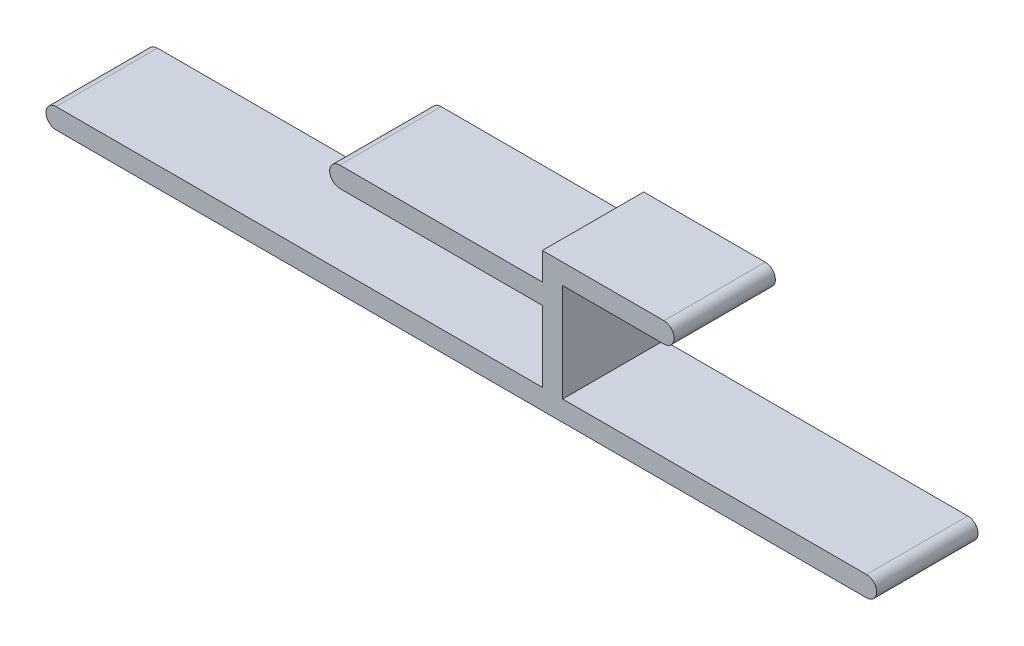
from build123d import *

# Parameters (mm, degrees)
BOSS_EXTRUDE1_DEPTH = 10


with BuildPart() as part:
    # Sketch1 → Boss-Extrude1 (new body)
    with BuildSketch(Plane(origin=(0, 0, 0), x_dir=(0, -1, 0), z_dir=(0, 0, 1))):
        with BuildLine():
            Line((0, -50), (0, -2))
            Line((0, -2), (-7, -2))
            Line((-7, -2), (-7, -22))
            ThreePointArc((-7, -22), (-8, -23), (-9, -22))
            Line((-9, -22), (-9, -2))
            Line((-9, -2), (-11.7, -2))
            Line((-11.7, -2), (-11.7, 10))
            ThreePointArc((-11.7, 10), (-10.7, 11), (-9.7, 10))
            Line((-9.7, 10), (-9.7, 0))
            Line((-9.7, 0), (0, 0))
            Line((0, 0), (0, 30))
            ThreePointArc((0, 30), (1, 31), (2, 30))
            Line((2, 30), (2, -50))
            ThreePointArc((2, -50), (1, -51), (0, -50))
        make_face()
    extrude(amount=BOSS_EXTRUDE1_DEPTH)


solid = part.part
